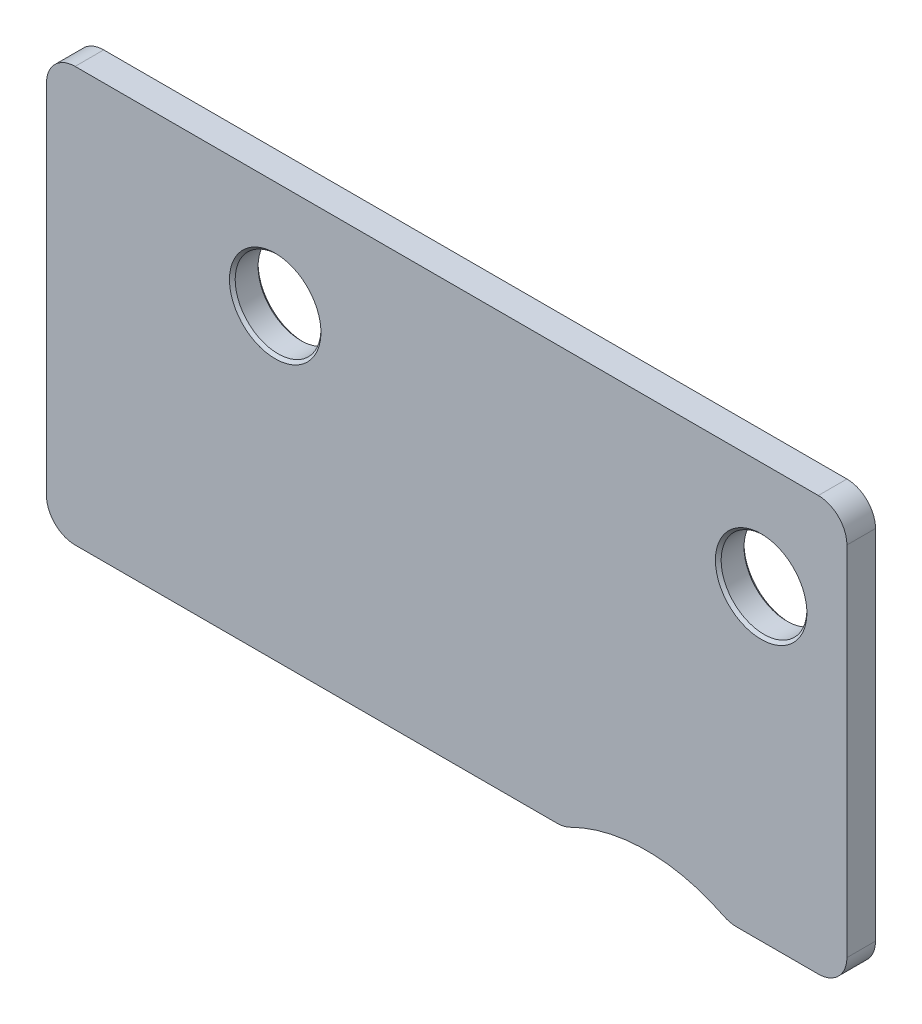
from build123d import *

# Parameters (mm, degrees)
ESQUISSE1_R      = 1.5
EXTRUSION1_DEPTH = 1
CONG_1_R         = 1
CHANFREIN1_SIZE  = 0.1


with BuildPart() as part:
    # Esquisse1 → Extrusion1 (new body)
    with BuildSketch(Plane.XY):
        with BuildLine():
            Line((0, 0), (28, 0))
            Line((28, 0), (28, -14.5))
            Line((28, -14.5), (23.889651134, -14.5))
            ThreePointArc((23.889651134, -14.5), (21, -13.758318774), (18.110348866, -14.5))
            Line((18.110348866, -14.5), (0, -14.5))
            Line((0, -14.5), (0, 0))
        make_face()
        with Locations((25, -3.758318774)):
            Circle(ESQUISSE1_R, mode=Mode.SUBTRACT)
        with Locations((8, -3.758318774)):
            Circle(ESQUISSE1_R, mode=Mode.SUBTRACT)
    extrude(amount=EXTRUSION1_DEPTH)

    # Cong_1
    cong_1_edges = [part.edges().sort_by_distance(p)[0] for p in [
        (28, -14.5, 0.5),
        (23.889651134, -14.5, 0.5),
        (18.110348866, -14.5, 0.5),
        (0, -14.5, 0.5),
        (0, 0, 0.5),
        (28, 0, 0.5),
    ]]
    fillet(cong_1_edges, radius=CONG_1_R)

    # Chanfrein1
    chanfrein1_edges = [part.edges().sort_by_distance(p)[0] for p in [
        (23.5, -3.758318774, 0),
        (23.5, -3.758318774, 1),
        (6.5, -3.758318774, 0),
        (6.5, -3.758318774, 1),
    ]]
    chamfer(chanfrein1_edges, length=CHANFREIN1_SIZE)


solid = part.part
